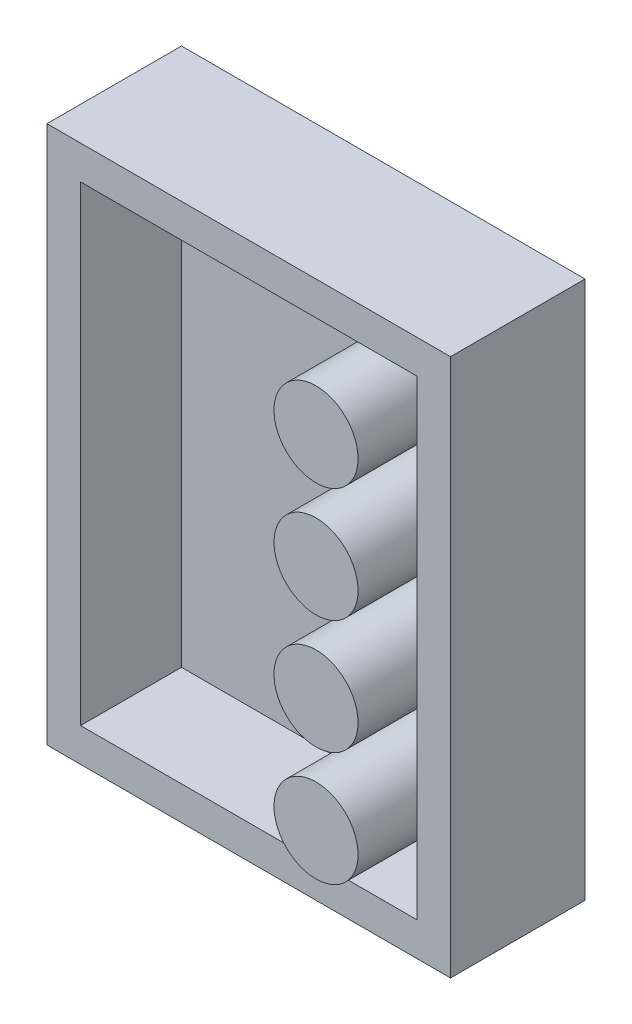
ISO-10303-21;
HEADER;
FILE_DESCRIPTION(('STEP AP214'),'2;1');
FILE_NAME('part.step','',(''),(''),'','','');
FILE_SCHEMA(('AUTOMOTIVE_DESIGN { 1 0 10303 214 1 1 1 1 }'));
ENDSEC;
DATA;
#1=APPLICATION_CONTEXT('core data for automotive mechanical design processes');
#2=APPLICATION_PROTOCOL_DEFINITION('international standard','automotive_design',2000,#1);
#3=PRODUCT_CONTEXT('',#1,'mechanical');
#4=PRODUCT('Part','Part','',(#3));
#5=PRODUCT_RELATED_PRODUCT_CATEGORY('part','',(#4));
#6=PRODUCT_DEFINITION_FORMATION('','',#4);
#7=PRODUCT_DEFINITION_CONTEXT('part definition',#1,'design');
#8=PRODUCT_DEFINITION('design','',#6,#7);
#9=PRODUCT_DEFINITION_SHAPE('','',#8);
#10=(LENGTH_UNIT() NAMED_UNIT(*) SI_UNIT(.MILLI.,.METRE.));
#11=(NAMED_UNIT(*) PLANE_ANGLE_UNIT() SI_UNIT($,.RADIAN.));
#12=(NAMED_UNIT(*) SI_UNIT($,.STERADIAN.) SOLID_ANGLE_UNIT());
#13=UNCERTAINTY_MEASURE_WITH_UNIT(LENGTH_MEASURE(1.E-05),#10,'distance_accuracy_value','');
#14=(GEOMETRIC_REPRESENTATION_CONTEXT(3) GLOBAL_UNCERTAINTY_ASSIGNED_CONTEXT((#13)) GLOBAL_UNIT_ASSIGNED_CONTEXT((#10,
#11,#12)) REPRESENTATION_CONTEXT('',''));
#15=CARTESIAN_POINT('',(0.,0.,0.));
#16=DIRECTION('',(0.,0.,1.));
#17=DIRECTION('',(1.,0.,0.));
#18=AXIS2_PLACEMENT_3D('',#15,#16,#17);
#19=CARTESIAN_POINT('',(4.5,6.5,2.5));
#20=DIRECTION('',(0.,0.,1.));
#21=DIRECTION('',(1.,0.,0.));
#22=AXIS2_PLACEMENT_3D('',#19,#20,#21);
#23=PLANE('',#22);
#24=CARTESIAN_POINT('',(4.5,6.5,2.5));
#25=DIRECTION('',(0.,0.,1.));
#26=DIRECTION('',(1.,0.,0.));
#27=AXIS2_PLACEMENT_3D('',#24,#25,#26);
#28=CIRCLE('',#27,0.625);
#29=CARTESIAN_POINT('',(5.125,6.5,2.5));
#30=VERTEX_POINT('',#29);
#31=EDGE_CURVE('E20',#30,#30,#28,.F.);
#32=ORIENTED_EDGE('',*,*,#31,.F.);
#33=EDGE_LOOP('',(#32));
#34=FACE_BOUND('',#33,.T.);
#35=ADVANCED_FACE('F17',(#34),#23,.T.);
#36=CARTESIAN_POINT('',(4.5,4.8,2.5));
#37=DIRECTION('',(0.,0.,1.));
#38=DIRECTION('',(1.,0.,0.));
#39=AXIS2_PLACEMENT_3D('',#36,#37,#38);
#40=PLANE('',#39);
#41=CARTESIAN_POINT('',(4.5,4.8,2.5));
#42=DIRECTION('',(0.,0.,1.));
#43=DIRECTION('',(1.,0.,0.));
#44=AXIS2_PLACEMENT_3D('',#41,#42,#43);
#45=CIRCLE('',#44,0.625);
#46=CARTESIAN_POINT('',(5.125,4.8,2.5));
#47=VERTEX_POINT('',#46);
#48=EDGE_CURVE('E124',#47,#47,#45,.F.);
#49=ORIENTED_EDGE('',*,*,#48,.F.);
#50=EDGE_LOOP('',(#49));
#51=FACE_BOUND('',#50,.T.);
#52=ADVANCED_FACE('F135',(#51),#40,.T.);
#53=CARTESIAN_POINT('',(4.5,3.1,2.5));
#54=DIRECTION('',(0.,0.,1.));
#55=DIRECTION('',(1.,0.,0.));
#56=AXIS2_PLACEMENT_3D('',#53,#54,#55);
#57=PLANE('',#56);
#58=CARTESIAN_POINT('',(4.5,3.1,2.5));
#59=DIRECTION('',(0.,0.,1.));
#60=DIRECTION('',(1.,0.,0.));
#61=AXIS2_PLACEMENT_3D('',#58,#59,#60);
#62=CIRCLE('',#61,0.625);
#63=CARTESIAN_POINT('',(5.125,3.1,2.5));
#64=VERTEX_POINT('',#63);
#65=EDGE_CURVE('E122',#64,#64,#62,.F.);
#66=ORIENTED_EDGE('',*,*,#65,.F.);
#67=EDGE_LOOP('',(#66));
#68=FACE_BOUND('',#67,.T.);
#69=ADVANCED_FACE('F140',(#68),#57,.T.);
#70=CARTESIAN_POINT('',(4.5,1.4,2.5));
#71=DIRECTION('',(0.,0.,1.));
#72=DIRECTION('',(1.,0.,0.));
#73=AXIS2_PLACEMENT_3D('',#70,#71,#72);
#74=PLANE('',#73);
#75=CARTESIAN_POINT('',(4.5,1.4,2.5));
#76=DIRECTION('',(0.,0.,1.));
#77=DIRECTION('',(1.,0.,0.));
#78=AXIS2_PLACEMENT_3D('',#75,#76,#77);
#79=CIRCLE('',#78,0.625);
#80=CARTESIAN_POINT('',(5.125,1.4,2.5));
#81=VERTEX_POINT('',#80);
#82=EDGE_CURVE('E119',#81,#81,#79,.F.);
#83=ORIENTED_EDGE('',*,*,#82,.F.);
#84=EDGE_LOOP('',(#83));
#85=FACE_BOUND('',#84,.T.);
#86=ADVANCED_FACE('F196',(#85),#74,.T.);
#87=CARTESIAN_POINT('',(4.5,6.5,0.5));
#88=DIRECTION('',(0.,0.,1.));
#89=DIRECTION('',(1.,0.,0.));
#90=AXIS2_PLACEMENT_3D('',#87,#88,#89);
#91=CYLINDRICAL_SURFACE('',#90,0.625);
#92=ORIENTED_EDGE('',*,*,#31,.T.);
#93=EDGE_LOOP('',(#92));
#94=FACE_BOUND('',#93,.T.);
#95=CARTESIAN_POINT('',(4.5,6.5,0.5));
#96=DIRECTION('',(0.,0.,1.));
#97=DIRECTION('',(1.,0.,0.));
#98=AXIS2_PLACEMENT_3D('',#95,#96,#97);
#99=CIRCLE('',#98,0.625);
#100=CARTESIAN_POINT('',(5.125,6.5,0.5));
#101=VERTEX_POINT('',#100);
#102=EDGE_CURVE('E116',#101,#101,#99,.F.);
#103=ORIENTED_EDGE('',*,*,#102,.F.);
#104=EDGE_LOOP('',(#103));
#105=FACE_BOUND('',#104,.T.);
#106=ADVANCED_FACE('F131',(#94,#105),#91,.T.);
#107=CARTESIAN_POINT('',(4.5,4.8,0.5));
#108=DIRECTION('',(0.,0.,1.));
#109=DIRECTION('',(1.,0.,0.));
#110=AXIS2_PLACEMENT_3D('',#107,#108,#109);
#111=CYLINDRICAL_SURFACE('',#110,0.625);
#112=ORIENTED_EDGE('',*,*,#48,.T.);
#113=EDGE_LOOP('',(#112));
#114=FACE_BOUND('',#113,.T.);
#115=CARTESIAN_POINT('',(4.5,4.8,0.5));
#116=DIRECTION('',(0.,0.,1.));
#117=DIRECTION('',(1.,0.,0.));
#118=AXIS2_PLACEMENT_3D('',#115,#116,#117);
#119=CIRCLE('',#118,0.625);
#120=CARTESIAN_POINT('',(5.125,4.8,0.5));
#121=VERTEX_POINT('',#120);
#122=EDGE_CURVE('E113',#121,#121,#119,.F.);
#123=ORIENTED_EDGE('',*,*,#122,.F.);
#124=EDGE_LOOP('',(#123));
#125=FACE_BOUND('',#124,.T.);
#126=ADVANCED_FACE('F190',(#114,#125),#111,.T.);
#127=CARTESIAN_POINT('',(4.5,3.1,0.5));
#128=DIRECTION('',(0.,0.,1.));
#129=DIRECTION('',(1.,0.,0.));
#130=AXIS2_PLACEMENT_3D('',#127,#128,#129);
#131=CYLINDRICAL_SURFACE('',#130,0.625);
#132=ORIENTED_EDGE('',*,*,#65,.T.);
#133=EDGE_LOOP('',(#132));
#134=FACE_BOUND('',#133,.T.);
#135=CARTESIAN_POINT('',(4.5,3.1,0.5));
#136=DIRECTION('',(0.,0.,1.));
#137=DIRECTION('',(1.,0.,0.));
#138=AXIS2_PLACEMENT_3D('',#135,#136,#137);
#139=CIRCLE('',#138,0.625);
#140=CARTESIAN_POINT('',(5.125,3.1,0.5));
#141=VERTEX_POINT('',#140);
#142=EDGE_CURVE('E110',#141,#141,#139,.F.);
#143=ORIENTED_EDGE('',*,*,#142,.F.);
#144=EDGE_LOOP('',(#143));
#145=FACE_BOUND('',#144,.T.);
#146=ADVANCED_FACE('F186',(#134,#145),#131,.T.);
#147=CARTESIAN_POINT('',(4.5,1.4,0.5));
#148=DIRECTION('',(0.,0.,1.));
#149=DIRECTION('',(1.,0.,0.));
#150=AXIS2_PLACEMENT_3D('',#147,#148,#149);
#151=CYLINDRICAL_SURFACE('',#150,0.625);
#152=ORIENTED_EDGE('',*,*,#82,.T.);
#153=EDGE_LOOP('',(#152));
#154=FACE_BOUND('',#153,.T.);
#155=CARTESIAN_POINT('',(4.5,1.4,0.5));
#156=DIRECTION('',(0.,0.,1.));
#157=DIRECTION('',(1.,0.,0.));
#158=AXIS2_PLACEMENT_3D('',#155,#156,#157);
#159=CIRCLE('',#158,0.625);
#160=CARTESIAN_POINT('',(5.125,1.4,0.5));
#161=VERTEX_POINT('',#160);
#162=EDGE_CURVE('E94',#161,#161,#159,.F.);
#163=ORIENTED_EDGE('',*,*,#162,.F.);
#164=EDGE_LOOP('',(#163));
#165=FACE_BOUND('',#164,.T.);
#166=ADVANCED_FACE('F183',(#154,#165),#151,.T.);
#167=CARTESIAN_POINT('',(3.,4.,0.5));
#168=DIRECTION('',(0.,0.,1.));
#169=DIRECTION('',(1.,0.,0.));
#170=AXIS2_PLACEMENT_3D('',#167,#168,#169);
#171=PLANE('',#170);
#172=DIRECTION('',(1.,0.,0.));
#173=VECTOR('',#172,1.);
#174=CARTESIAN_POINT('',(3.,0.5,0.5));
#175=LINE('',#174,#173);
#176=CARTESIAN_POINT('',(5.5,0.5,0.5));
#177=VERTEX_POINT('',#176);
#178=CARTESIAN_POINT('',(0.5,0.5,0.5));
#179=VERTEX_POINT('',#178);
#180=EDGE_CURVE('E79',#177,#179,#175,.F.);
#181=ORIENTED_EDGE('',*,*,#180,.F.);
#182=DIRECTION('',(0.,1.,0.));
#183=VECTOR('',#182,1.);
#184=CARTESIAN_POINT('',(5.5,4.,0.5));
#185=LINE('',#184,#183);
#186=CARTESIAN_POINT('',(5.5,7.5,0.5));
#187=VERTEX_POINT('',#186);
#188=EDGE_CURVE('E85',#187,#177,#185,.F.);
#189=ORIENTED_EDGE('',*,*,#188,.F.);
#190=DIRECTION('',(1.,0.,0.));
#191=VECTOR('',#190,1.);
#192=CARTESIAN_POINT('',(3.,7.5,0.5));
#193=LINE('',#192,#191);
#194=CARTESIAN_POINT('',(0.5,7.5,0.5));
#195=VERTEX_POINT('',#194);
#196=EDGE_CURVE('E402',#195,#187,#193,.T.);
#197=ORIENTED_EDGE('',*,*,#196,.F.);
#198=DIRECTION('',(0.,1.,0.));
#199=VECTOR('',#198,1.);
#200=CARTESIAN_POINT('',(0.5,4.,0.5));
#201=LINE('',#200,#199);
#202=EDGE_CURVE('E102',#179,#195,#201,.T.);
#203=ORIENTED_EDGE('',*,*,#202,.F.);
#204=EDGE_LOOP('',(#181,#189,#197,#203));
#205=FACE_BOUND('',#204,.T.);
#206=ORIENTED_EDGE('',*,*,#162,.T.);
#207=EDGE_LOOP('',(#206));
#208=FACE_BOUND('',#207,.T.);
#209=ORIENTED_EDGE('',*,*,#142,.T.);
#210=EDGE_LOOP('',(#209));
#211=FACE_BOUND('',#210,.T.);
#212=ORIENTED_EDGE('',*,*,#122,.T.);
#213=EDGE_LOOP('',(#212));
#214=FACE_BOUND('',#213,.T.);
#215=ORIENTED_EDGE('',*,*,#102,.T.);
#216=EDGE_LOOP('',(#215));
#217=FACE_BOUND('',#216,.T.);
#218=ADVANCED_FACE('F100',(#205,#208,#211,#214,#217),#171,.T.);
#219=CARTESIAN_POINT('',(5.5,4.,1.));
#220=DIRECTION('',(-1.,0.,0.));
#221=DIRECTION('',(0.,0.,1.));
#222=AXIS2_PLACEMENT_3D('',#219,#220,#221);
#223=PLANE('',#222);
#224=DIRECTION('',(0.,0.,-1.));
#225=VECTOR('',#224,1.);
#226=CARTESIAN_POINT('',(5.5,7.5,1.));
#227=LINE('',#226,#225);
#228=CARTESIAN_POINT('',(5.5,7.5,2.));
#229=VERTEX_POINT('',#228);
#230=EDGE_CURVE('E90',#187,#229,#227,.F.);
#231=ORIENTED_EDGE('',*,*,#230,.F.);
#232=ORIENTED_EDGE('',*,*,#188,.T.);
#233=DIRECTION('',(0.,0.,1.));
#234=VECTOR('',#233,1.);
#235=CARTESIAN_POINT('',(5.5,0.5,1.));
#236=LINE('',#235,#234);
#237=CARTESIAN_POINT('',(5.5,0.5,2.));
#238=VERTEX_POINT('',#237);
#239=EDGE_CURVE('E88',#238,#177,#236,.F.);
#240=ORIENTED_EDGE('',*,*,#239,.F.);
#241=DIRECTION('',(0.,1.,0.));
#242=VECTOR('',#241,1.);
#243=CARTESIAN_POINT('',(5.5,4.,2.));
#244=LINE('',#243,#242);
#245=EDGE_CURVE('E397',#229,#238,#244,.F.);
#246=ORIENTED_EDGE('',*,*,#245,.F.);
#247=EDGE_LOOP('',(#231,#232,#240,#246));
#248=FACE_BOUND('',#247,.T.);
#249=ADVANCED_FACE('F86',(#248),#223,.T.);
#250=CARTESIAN_POINT('',(3.,0.5,1.));
#251=DIRECTION('',(0.,1.,0.));
#252=DIRECTION('',(0.,0.,1.));
#253=AXIS2_PLACEMENT_3D('',#250,#251,#252);
#254=PLANE('',#253);
#255=ORIENTED_EDGE('',*,*,#239,.T.);
#256=ORIENTED_EDGE('',*,*,#180,.T.);
#257=DIRECTION('',(0.,0.,-1.));
#258=VECTOR('',#257,1.);
#259=CARTESIAN_POINT('',(0.5,0.5,1.));
#260=LINE('',#259,#258);
#261=CARTESIAN_POINT('',(0.5,0.5,2.));
#262=VERTEX_POINT('',#261);
#263=EDGE_CURVE('E103',#262,#179,#260,.T.);
#264=ORIENTED_EDGE('',*,*,#263,.F.);
#265=DIRECTION('',(1.,0.,0.));
#266=VECTOR('',#265,1.);
#267=CARTESIAN_POINT('',(3.,0.5,2.));
#268=LINE('',#267,#266);
#269=EDGE_CURVE('E97',#238,#262,#268,.F.);
#270=ORIENTED_EDGE('',*,*,#269,.F.);
#271=EDGE_LOOP('',(#255,#256,#264,#270));
#272=FACE_BOUND('',#271,.T.);
#273=ADVANCED_FACE('F96',(#272),#254,.T.);
#274=CARTESIAN_POINT('',(0.5,4.,1.));
#275=DIRECTION('',(1.,0.,0.));
#276=DIRECTION('',(0.,0.,-1.));
#277=AXIS2_PLACEMENT_3D('',#274,#275,#276);
#278=PLANE('',#277);
#279=ORIENTED_EDGE('',*,*,#263,.T.);
#280=ORIENTED_EDGE('',*,*,#202,.T.);
#281=DIRECTION('',(0.,0.,-1.));
#282=VECTOR('',#281,1.);
#283=CARTESIAN_POINT('',(0.5,7.5,1.));
#284=LINE('',#283,#282);
#285=CARTESIAN_POINT('',(0.5,7.5,2.));
#286=VERTEX_POINT('',#285);
#287=EDGE_CURVE('E389',#286,#195,#284,.T.);
#288=ORIENTED_EDGE('',*,*,#287,.F.);
#289=DIRECTION('',(0.,1.,0.));
#290=VECTOR('',#289,1.);
#291=CARTESIAN_POINT('',(0.5,4.,2.));
#292=LINE('',#291,#290);
#293=EDGE_CURVE('E388',#262,#286,#292,.T.);
#294=ORIENTED_EDGE('',*,*,#293,.F.);
#295=EDGE_LOOP('',(#279,#280,#288,#294));
#296=FACE_BOUND('',#295,.T.);
#297=ADVANCED_FACE('F172',(#296),#278,.T.);
#298=CARTESIAN_POINT('',(3.,7.5,1.));
#299=DIRECTION('',(0.,-1.,0.));
#300=DIRECTION('',(0.,0.,-1.));
#301=AXIS2_PLACEMENT_3D('',#298,#299,#300);
#302=PLANE('',#301);
#303=ORIENTED_EDGE('',*,*,#287,.T.);
#304=ORIENTED_EDGE('',*,*,#196,.T.);
#305=ORIENTED_EDGE('',*,*,#230,.T.);
#306=DIRECTION('',(1.,0.,0.));
#307=VECTOR('',#306,1.);
#308=CARTESIAN_POINT('',(3.,7.5,2.));
#309=LINE('',#308,#307);
#310=EDGE_CURVE('E393',#286,#229,#309,.T.);
#311=ORIENTED_EDGE('',*,*,#310,.F.);
#312=EDGE_LOOP('',(#303,#304,#305,#311));
#313=FACE_BOUND('',#312,.T.);
#314=ADVANCED_FACE('F168',(#313),#302,.T.);
#315=CARTESIAN_POINT('',(3.,4.,2.));
#316=DIRECTION('',(0.,0.,1.));
#317=DIRECTION('',(1.,0.,0.));
#318=AXIS2_PLACEMENT_3D('',#315,#316,#317);
#319=PLANE('',#318);
#320=DIRECTION('',(1.,0.,0.));
#321=VECTOR('',#320,1.);
#322=CARTESIAN_POINT('',(3.,0.,2.));
#323=LINE('',#322,#321);
#324=CARTESIAN_POINT('',(0.,0.,2.));
#325=VERTEX_POINT('',#324);
#326=CARTESIAN_POINT('',(6.,0.,2.));
#327=VERTEX_POINT('',#326);
#328=EDGE_CURVE('E407',#325,#327,#323,.T.);
#329=ORIENTED_EDGE('',*,*,#328,.T.);
#330=DIRECTION('',(0.,1.,0.));
#331=VECTOR('',#330,1.);
#332=CARTESIAN_POINT('',(6.,4.,2.));
#333=LINE('',#332,#331);
#334=CARTESIAN_POINT('',(6.,8.,2.));
#335=VERTEX_POINT('',#334);
#336=EDGE_CURVE('E413',#327,#335,#333,.T.);
#337=ORIENTED_EDGE('',*,*,#336,.T.);
#338=DIRECTION('',(1.,0.,0.));
#339=VECTOR('',#338,1.);
#340=CARTESIAN_POINT('',(3.,8.,2.));
#341=LINE('',#340,#339);
#342=CARTESIAN_POINT('',(0.,8.,2.));
#343=VERTEX_POINT('',#342);
#344=EDGE_CURVE('E419',#335,#343,#341,.F.);
#345=ORIENTED_EDGE('',*,*,#344,.T.);
#346=DIRECTION('',(0.,1.,0.));
#347=VECTOR('',#346,1.);
#348=CARTESIAN_POINT('',(0.,4.,2.));
#349=LINE('',#348,#347);
#350=EDGE_CURVE('E395',#343,#325,#349,.F.);
#351=ORIENTED_EDGE('',*,*,#350,.T.);
#352=EDGE_LOOP('',(#329,#337,#345,#351));
#353=FACE_BOUND('',#352,.T.);
#354=ORIENTED_EDGE('',*,*,#293,.T.);
#355=ORIENTED_EDGE('',*,*,#310,.T.);
#356=ORIENTED_EDGE('',*,*,#245,.T.);
#357=ORIENTED_EDGE('',*,*,#269,.T.);
#358=EDGE_LOOP('',(#354,#355,#356,#357));
#359=FACE_BOUND('',#358,.T.);
#360=ADVANCED_FACE('F164',(#353,#359),#319,.T.);
#361=CARTESIAN_POINT('',(0.,4.,1.));
#362=DIRECTION('',(1.,0.,0.));
#363=DIRECTION('',(0.,0.,-1.));
#364=AXIS2_PLACEMENT_3D('',#361,#362,#363);
#365=PLANE('',#364);
#366=DIRECTION('',(0.,1.,0.));
#367=VECTOR('',#366,1.);
#368=CARTESIAN_POINT('',(0.,4.,0.));
#369=LINE('',#368,#367);
#370=CARTESIAN_POINT('',(0.,8.,0.));
#371=VERTEX_POINT('',#370);
#372=CARTESIAN_POINT('',(0.,0.,0.));
#373=VERTEX_POINT('',#372);
#374=EDGE_CURVE('E426',#371,#373,#369,.F.);
#375=ORIENTED_EDGE('',*,*,#374,.T.);
#376=DIRECTION('',(0.,0.,1.));
#377=VECTOR('',#376,1.);
#378=CARTESIAN_POINT('',(0.,0.,1.));
#379=LINE('',#378,#377);
#380=EDGE_CURVE('E410',#373,#325,#379,.T.);
#381=ORIENTED_EDGE('',*,*,#380,.T.);
#382=ORIENTED_EDGE('',*,*,#350,.F.);
#383=DIRECTION('',(0.,0.,-1.));
#384=VECTOR('',#383,1.);
#385=CARTESIAN_POINT('',(0.,8.,1.));
#386=LINE('',#385,#384);
#387=EDGE_CURVE('E422',#343,#371,#386,.T.);
#388=ORIENTED_EDGE('',*,*,#387,.T.);
#389=EDGE_LOOP('',(#375,#381,#382,#388));
#390=FACE_BOUND('',#389,.T.);
#391=ADVANCED_FACE('F160',(#390),#365,.F.);
#392=CARTESIAN_POINT('',(3.,0.,1.));
#393=DIRECTION('',(0.,1.,0.));
#394=DIRECTION('',(0.,0.,1.));
#395=AXIS2_PLACEMENT_3D('',#392,#393,#394);
#396=PLANE('',#395);
#397=DIRECTION('',(1.,0.,0.));
#398=VECTOR('',#397,1.);
#399=CARTESIAN_POINT('',(3.,0.,0.));
#400=LINE('',#399,#398);
#401=CARTESIAN_POINT('',(6.,0.,0.));
#402=VERTEX_POINT('',#401);
#403=EDGE_CURVE('E429',#373,#402,#400,.T.);
#404=ORIENTED_EDGE('',*,*,#403,.T.);
#405=DIRECTION('',(0.,0.,1.));
#406=VECTOR('',#405,1.);
#407=CARTESIAN_POINT('',(6.,0.,1.));
#408=LINE('',#407,#406);
#409=EDGE_CURVE('E416',#402,#327,#408,.T.);
#410=ORIENTED_EDGE('',*,*,#409,.T.);
#411=ORIENTED_EDGE('',*,*,#328,.F.);
#412=ORIENTED_EDGE('',*,*,#380,.F.);
#413=EDGE_LOOP('',(#404,#410,#411,#412));
#414=FACE_BOUND('',#413,.T.);
#415=ADVANCED_FACE('F156',(#414),#396,.F.);
#416=CARTESIAN_POINT('',(6.,4.,1.));
#417=DIRECTION('',(-1.,0.,0.));
#418=DIRECTION('',(0.,0.,1.));
#419=AXIS2_PLACEMENT_3D('',#416,#417,#418);
#420=PLANE('',#419);
#421=DIRECTION('',(0.,1.,0.));
#422=VECTOR('',#421,1.);
#423=CARTESIAN_POINT('',(6.,4.,0.));
#424=LINE('',#423,#422);
#425=CARTESIAN_POINT('',(6.,8.,0.));
#426=VERTEX_POINT('',#425);
#427=EDGE_CURVE('E26',#402,#426,#424,.T.);
#428=ORIENTED_EDGE('',*,*,#427,.T.);
#429=DIRECTION('',(0.,0.,-1.));
#430=VECTOR('',#429,1.);
#431=CARTESIAN_POINT('',(6.,8.,1.));
#432=LINE('',#431,#430);
#433=EDGE_CURVE('E34',#426,#335,#432,.F.);
#434=ORIENTED_EDGE('',*,*,#433,.T.);
#435=ORIENTED_EDGE('',*,*,#336,.F.);
#436=ORIENTED_EDGE('',*,*,#409,.F.);
#437=EDGE_LOOP('',(#428,#434,#435,#436));
#438=FACE_BOUND('',#437,.T.);
#439=ADVANCED_FACE('F150',(#438),#420,.F.);
#440=CARTESIAN_POINT('',(3.,8.,1.));
#441=DIRECTION('',(0.,-1.,0.));
#442=DIRECTION('',(0.,0.,-1.));
#443=AXIS2_PLACEMENT_3D('',#440,#441,#442);
#444=PLANE('',#443);
#445=DIRECTION('',(1.,0.,0.));
#446=VECTOR('',#445,1.);
#447=CARTESIAN_POINT('',(3.,8.,0.));
#448=LINE('',#447,#446);
#449=EDGE_CURVE('E11',#426,#371,#448,.F.);
#450=ORIENTED_EDGE('',*,*,#449,.T.);
#451=ORIENTED_EDGE('',*,*,#387,.F.);
#452=ORIENTED_EDGE('',*,*,#344,.F.);
#453=ORIENTED_EDGE('',*,*,#433,.F.);
#454=EDGE_LOOP('',(#450,#451,#452,#453));
#455=FACE_BOUND('',#454,.T.);
#456=ADVANCED_FACE('F144',(#455),#444,.F.);
#457=CARTESIAN_POINT('',(3.,4.,0.));
#458=DIRECTION('',(0.,0.,1.));
#459=DIRECTION('',(1.,0.,0.));
#460=AXIS2_PLACEMENT_3D('',#457,#458,#459);
#461=PLANE('',#460);
#462=ORIENTED_EDGE('',*,*,#427,.F.);
#463=ORIENTED_EDGE('',*,*,#403,.F.);
#464=ORIENTED_EDGE('',*,*,#374,.F.);
#465=ORIENTED_EDGE('',*,*,#449,.F.);
#466=EDGE_LOOP('',(#462,#463,#464,#465));
#467=FACE_BOUND('',#466,.T.);
#468=ADVANCED_FACE('F142',(#467),#461,.F.);
#469=CLOSED_SHELL('',(#35,#52,#69,#86,#106,#126,#146,#166,#218,#249,#273,#297,#314,#360,#391,
#415,#439,#456,#468));
#470=MANIFOLD_SOLID_BREP('B1',#469);
#471=ADVANCED_BREP_SHAPE_REPRESENTATION('',(#18,#470),#14);
#472=SHAPE_DEFINITION_REPRESENTATION(#9,#471);
ENDSEC;
END-ISO-10303-21;
